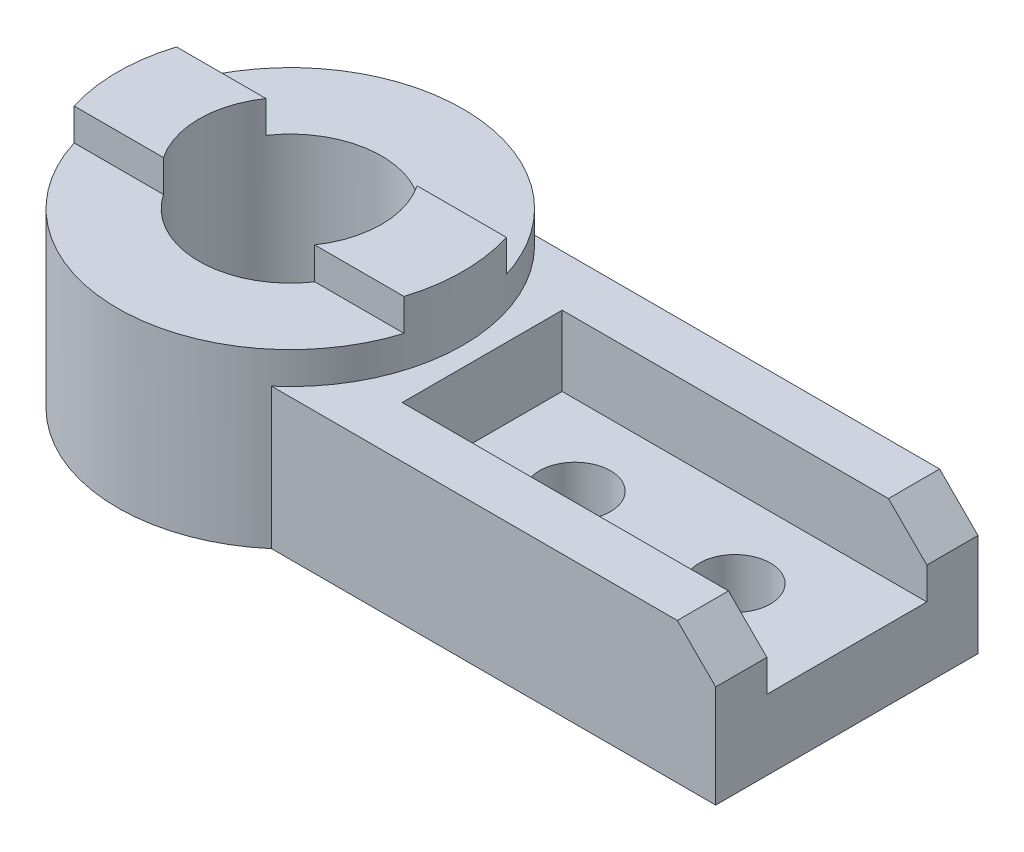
from build123d import *
from build123d.topology import SkipClean

# Parameters (mm, degrees)
SKETCH1_R           = 11.1
BOSS_EXTRUDE1_DEPTH = 44
SKETCH2_W           = 114
SKETCH2_H           = 50
CUT_EXTRUDE1_DEPTH  = 22
CUT_EXTRUDE2_DEPTH  = 198.322071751
SKETCH4_R           = 54
SKETCH4_R_2         = 28.55
BOSS_EXTRUDE2_DEPTH = 54
BOSS_EXTRUDE3_DEPTH = 10


with BuildPart() as part:
    # Sketch1 → Boss-Extrude1 (new body)
    with BuildSketch(Plane(origin=(0, 0, 0), x_dir=(1, 0, 0), z_dir=(0, 1, 0))):
        with BuildLine():
            Line((174, -41), (174, 41))
            Line((174, 41), (35.142566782, 41))
            ThreePointArc((35.142566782, 41), (54, 0), (35.142566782, -41))
            Line((35.142566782, -41), (174, -41))
        make_face()
        with Locations(Location((89, 0, 0), (0, 0, 270))):
            Circle(SKETCH1_R, mode=Mode.SUBTRACT)
        with Locations(Location((139, 0, 0), (0, 0, 270))):
            Circle(SKETCH1_R, mode=Mode.SUBTRACT)
    extrude(amount=BOSS_EXTRUDE1_DEPTH)

    # Sketch2 → Cut-Extrude1 (cut)
    with BuildSketch(Plane(origin=(0, 44, 0), x_dir=(1, 0, 0), z_dir=(0, 1, 0))):
        with Locations((117, 0)):
            Rectangle(SKETCH2_W, SKETCH2_H)
    extrude(amount=-CUT_EXTRUDE1_DEPTH, mode=Mode.SUBTRACT)

    # Sketch3 → Cut-Extrude2 (cut, through all)
    with BuildSketch(Plane.XY.offset(41)):
        Polygon((174, 44), (174, 32), (162, 44), align=None)
    extrude(amount=-CUT_EXTRUDE2_DEPTH, mode=Mode.SUBTRACT)

    # Sketch4 → Boss-Extrude2 (add)
    with BuildSketch(Plane(origin=(0, 0, 0), x_dir=(1, 0, 0), z_dir=(0, 1, 0))):
        with Locations(Location((0, 0, 0), (0, 0, 49.398939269))):
            Circle(SKETCH4_R)
        with Locations(Location((0, 0, 0), (0, 0, 270))):
            Circle(SKETCH4_R_2, mode=Mode.SUBTRACT)
    extrude(amount=BOSS_EXTRUDE2_DEPTH)

    # Sketch5 → Boss-Extrude3 (add)
    with SkipClean():  # the faces are left unmerged after this step: merging them gives an invalid solid
        with BuildSketch(Plane(origin=(0, 54, 0), x_dir=(1, 0, 0), z_dir=(0, 1, 0))):
            with BuildLine():
                Line((51.575187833, 16), (23.64534838, 16))
                ThreePointArc((23.64534838, 16), (28.55, 0), (23.64534838, -16))
                Line((23.64534838, -16), (51.575187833, -16))
                ThreePointArc((51.575187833, -16), (54, 0), (51.575187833, 16))
            make_face()
            with BuildLine():
                Line((-23.64534838, -16), (-51.575187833, -16))
                ThreePointArc((-51.575187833, -16), (-54, 0), (-51.575187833, 16))
                Line((-51.575187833, 16), (-23.64534838, 16))
                ThreePointArc((-23.64534838, 16), (-28.55, 0), (-23.64534838, -16))
            make_face()
        extrude(amount=BOSS_EXTRUDE3_DEPTH)


solid = part.part
